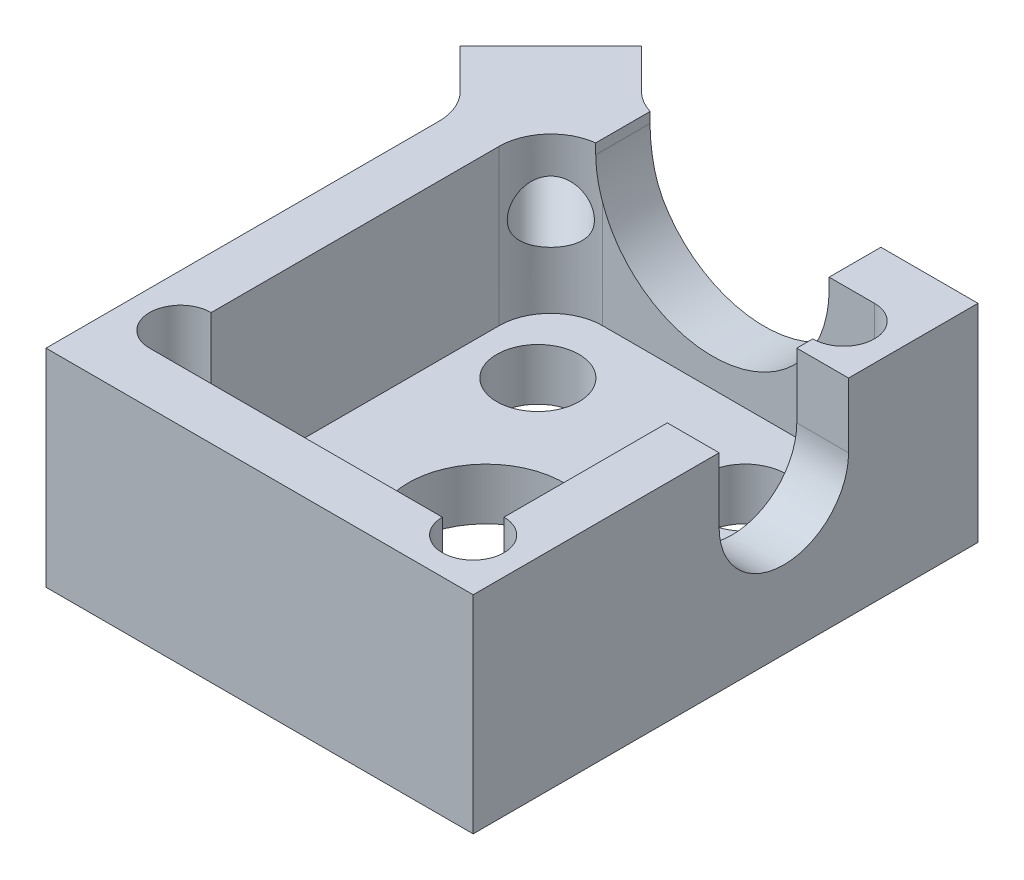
ISO-10303-21;
HEADER;
FILE_DESCRIPTION(('STEP AP214'),'2;1');
FILE_NAME('part.step','',(''),(''),'','','');
FILE_SCHEMA(('AUTOMOTIVE_DESIGN { 1 0 10303 214 1 1 1 1 }'));
ENDSEC;
DATA;
#1=APPLICATION_CONTEXT('core data for automotive mechanical design processes');
#2=APPLICATION_PROTOCOL_DEFINITION('international standard','automotive_design',2000,#1);
#3=PRODUCT_CONTEXT('',#1,'mechanical');
#4=PRODUCT('Part','Part','',(#3));
#5=PRODUCT_RELATED_PRODUCT_CATEGORY('part','',(#4));
#6=PRODUCT_DEFINITION_FORMATION('','',#4);
#7=PRODUCT_DEFINITION_CONTEXT('part definition',#1,'design');
#8=PRODUCT_DEFINITION('design','',#6,#7);
#9=PRODUCT_DEFINITION_SHAPE('','',#8);
#10=(LENGTH_UNIT() NAMED_UNIT(*) SI_UNIT(.MILLI.,.METRE.));
#11=(NAMED_UNIT(*) PLANE_ANGLE_UNIT() SI_UNIT($,.RADIAN.));
#12=(NAMED_UNIT(*) SI_UNIT($,.STERADIAN.) SOLID_ANGLE_UNIT());
#13=UNCERTAINTY_MEASURE_WITH_UNIT(LENGTH_MEASURE(1.E-05),#10,'distance_accuracy_value','');
#14=(GEOMETRIC_REPRESENTATION_CONTEXT(3) GLOBAL_UNCERTAINTY_ASSIGNED_CONTEXT((#13)) GLOBAL_UNIT_ASSIGNED_CONTEXT((#10,
#11,#12)) REPRESENTATION_CONTEXT('',''));
#15=CARTESIAN_POINT('',(0.,0.,0.));
#16=DIRECTION('',(0.,0.,1.));
#17=DIRECTION('',(1.,0.,0.));
#18=AXIS2_PLACEMENT_3D('',#15,#16,#17);
#19=CARTESIAN_POINT('',(4.125,4.,-4.875));
#20=DIRECTION('',(0.,0.,1.));
#21=DIRECTION('',(1.,0.,0.));
#22=AXIS2_PLACEMENT_3D('',#19,#20,#21);
#23=PLANE('',#22);
#24=CARTESIAN_POINT('',(0.,3.8,-4.875));
#25=DIRECTION('',(0.,0.,1.));
#26=DIRECTION('',(1.,0.,0.));
#27=AXIS2_PLACEMENT_3D('',#24,#25,#26);
#28=CIRCLE('',#27,2.25);
#29=CARTESIAN_POINT('',(2.25,3.8,-4.875));
#30=VERTEX_POINT('',#29);
#31=CARTESIAN_POINT('',(-1.96078643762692,2.69645274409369,-4.875));
#32=VERTEX_POINT('',#31);
#33=EDGE_CURVE('E87',#30,#32,#28,.F.);
#34=ORIENTED_EDGE('',*,*,#33,.F.);
#35=DIRECTION('',(0.,-1.,0.));
#36=VECTOR('',#35,1.);
#37=CARTESIAN_POINT('',(2.25,4.,-4.875));
#38=LINE('',#37,#36);
#39=CARTESIAN_POINT('',(2.25,4.,-4.875));
#40=VERTEX_POINT('',#39);
#41=EDGE_CURVE('E586',#40,#30,#38,.T.);
#42=ORIENTED_EDGE('',*,*,#41,.F.);
#43=DIRECTION('',(-1.,0.,0.));
#44=VECTOR('',#43,1.);
#45=CARTESIAN_POINT('',(4.125,4.,-4.875));
#46=LINE('',#45,#44);
#47=CARTESIAN_POINT('',(4.125,4.,-4.875));
#48=VERTEX_POINT('',#47);
#49=EDGE_CURVE('E38',#48,#40,#46,.T.);
#50=ORIENTED_EDGE('',*,*,#49,.F.);
#51=DIRECTION('',(0.,-1.,0.));
#52=VECTOR('',#51,1.);
#53=CARTESIAN_POINT('',(4.125,4.,-4.875));
#54=LINE('',#53,#52);
#55=CARTESIAN_POINT('',(4.125,0.,-4.875));
#56=VERTEX_POINT('',#55);
#57=EDGE_CURVE('E363',#48,#56,#54,.T.);
#58=ORIENTED_EDGE('',*,*,#57,.T.);
#59=DIRECTION('',(-1.,0.,0.));
#60=VECTOR('',#59,1.);
#61=CARTESIAN_POINT('',(4.125,0.,-4.875));
#62=LINE('',#61,#60);
#63=CARTESIAN_POINT('',(-1.96078643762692,0.,-4.875));
#64=VERTEX_POINT('',#63);
#65=EDGE_CURVE('E349',#56,#64,#62,.T.);
#66=ORIENTED_EDGE('',*,*,#65,.T.);
#67=DIRECTION('',(0.,1.,0.));
#68=VECTOR('',#67,1.);
#69=CARTESIAN_POINT('',(-1.96078643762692,4.,-4.875));
#70=LINE('',#69,#68);
#71=EDGE_CURVE('E385',#64,#32,#70,.T.);
#72=ORIENTED_EDGE('',*,*,#71,.T.);
#73=EDGE_LOOP('',(#34,#42,#50,#58,#66,#72));
#74=FACE_BOUND('',#73,.T.);
#75=ADVANCED_FACE('F34',(#74),#23,.F.);
#76=CARTESIAN_POINT('',(0.,4.,0.));
#77=DIRECTION('',(0.,-1.,0.));
#78=DIRECTION('',(0.,0.,-1.));
#79=AXIS2_PLACEMENT_3D('',#76,#77,#78);
#80=PLANE('',#79);
#81=DIRECTION('',(0.,0.,1.));
#82=VECTOR('',#81,1.);
#83=CARTESIAN_POINT('',(-2.25,4.,0.));
#84=LINE('',#83,#82);
#85=CARTESIAN_POINT('',(-2.25,4.,-4.91773539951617));
#86=VERTEX_POINT('',#85);
#87=CARTESIAN_POINT('',(-2.25,4.,-3.86715674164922));
#88=VERTEX_POINT('',#87);
#89=EDGE_CURVE('E548',#86,#88,#84,.T.);
#90=ORIENTED_EDGE('',*,*,#89,.F.);
#91=CARTESIAN_POINT('',(-1.96078643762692,4.,-5.875));
#92=DIRECTION('',(0.,-1.,0.));
#93=DIRECTION('',(0.,0.,-1.));
#94=AXIS2_PLACEMENT_3D('',#91,#92,#93);
#95=CIRCLE('',#94,1.);
#96=CARTESIAN_POINT('',(-2.66789321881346,4.,-5.16789321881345));
#97=VERTEX_POINT('',#96);
#98=EDGE_CURVE('E393',#86,#97,#95,.T.);
#99=ORIENTED_EDGE('',*,*,#98,.T.);
#100=DIRECTION('',(-0.707106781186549,0.,-0.707106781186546));
#101=VECTOR('',#100,1.);
#102=CARTESIAN_POINT('',(-2.37500000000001,4.,-4.875));
#103=LINE('',#102,#101);
#104=CARTESIAN_POINT('',(-3.42677669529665,4.,-5.92677669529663));
#105=VERTEX_POINT('',#104);
#106=EDGE_CURVE('E228',#97,#105,#103,.T.);
#107=ORIENTED_EDGE('',*,*,#106,.T.);
#108=DIRECTION('',(-0.707106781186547,0.,0.707106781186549));
#109=VECTOR('',#108,1.);
#110=CARTESIAN_POINT('',(-3.42677669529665,4.,-5.92677669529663));
#111=LINE('',#110,#109);
#112=CARTESIAN_POINT('',(-5.17677669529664,4.,-4.17677669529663));
#113=VERTEX_POINT('',#112);
#114=EDGE_CURVE('E222',#105,#113,#111,.T.);
#115=ORIENTED_EDGE('',*,*,#114,.T.);
#116=DIRECTION('',(0.707106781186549,0.,0.707106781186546));
#117=VECTOR('',#116,1.);
#118=CARTESIAN_POINT('',(-5.17677669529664,4.,-4.17677669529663));
#119=LINE('',#118,#117);
#120=CARTESIAN_POINT('',(-4.41789321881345,4.,-3.41789321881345));
#121=VERTEX_POINT('',#120);
#122=EDGE_CURVE('E214',#113,#121,#119,.T.);
#123=ORIENTED_EDGE('',*,*,#122,.T.);
#124=CARTESIAN_POINT('',(-5.125,4.,-2.7107864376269));
#125=DIRECTION('',(0.,-1.,0.));
#126=DIRECTION('',(0.,0.,-1.));
#127=AXIS2_PLACEMENT_3D('',#124,#125,#126);
#128=CIRCLE('',#127,1.);
#129=CARTESIAN_POINT('',(-4.125,4.,-2.7107864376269));
#130=VERTEX_POINT('',#129);
#131=EDGE_CURVE('E200',#121,#130,#128,.T.);
#132=ORIENTED_EDGE('',*,*,#131,.T.);
#133=DIRECTION('',(0.,0.,1.));
#134=VECTOR('',#133,1.);
#135=CARTESIAN_POINT('',(-4.125,4.,-4.875));
#136=LINE('',#135,#134);
#137=CARTESIAN_POINT('',(-4.125,4.,4.875));
#138=VERTEX_POINT('',#137);
#139=EDGE_CURVE('E346',#130,#138,#136,.T.);
#140=ORIENTED_EDGE('',*,*,#139,.T.);
#141=DIRECTION('',(1.,0.,0.));
#142=VECTOR('',#141,1.);
#143=CARTESIAN_POINT('',(4.125,4.,4.875));
#144=LINE('',#143,#142);
#145=CARTESIAN_POINT('',(4.125,4.,4.875));
#146=VERTEX_POINT('',#145);
#147=EDGE_CURVE('E348',#138,#146,#144,.T.);
#148=ORIENTED_EDGE('',*,*,#147,.T.);
#149=DIRECTION('',(0.,0.,-1.));
#150=VECTOR('',#149,1.);
#151=CARTESIAN_POINT('',(4.125,4.,-4.875));
#152=LINE('',#151,#150);
#153=CARTESIAN_POINT('',(4.125,4.,0.125));
#154=VERTEX_POINT('',#153);
#155=EDGE_CURVE('E352',#146,#154,#152,.T.);
#156=ORIENTED_EDGE('',*,*,#155,.T.);
#157=DIRECTION('',(1.,0.,0.));
#158=VECTOR('',#157,1.);
#159=CARTESIAN_POINT('',(-0.410533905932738,4.,0.125000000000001));
#160=LINE('',#159,#158);
#161=CARTESIAN_POINT('',(3.125,4.,0.125000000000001));
#162=VERTEX_POINT('',#161);
#163=EDGE_CURVE('E259',#162,#154,#160,.T.);
#164=ORIENTED_EDGE('',*,*,#163,.F.);
#165=DIRECTION('',(0.,0.,-1.));
#166=VECTOR('',#165,1.);
#167=CARTESIAN_POINT('',(3.125,4.,-3.875));
#168=LINE('',#167,#166);
#169=CARTESIAN_POINT('',(3.125,4.,3.2796875));
#170=VERTEX_POINT('',#169);
#171=EDGE_CURVE('E322',#170,#162,#168,.T.);
#172=ORIENTED_EDGE('',*,*,#171,.F.);
#173=CARTESIAN_POINT('',(3.125,4.,3.875));
#174=DIRECTION('',(0.,1.,0.));
#175=DIRECTION('',(0.,0.,1.));
#176=AXIS2_PLACEMENT_3D('',#173,#174,#175);
#177=CIRCLE('',#176,0.595312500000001);
#178=CARTESIAN_POINT('',(2.5296875,4.,3.875));
#179=VERTEX_POINT('',#178);
#180=EDGE_CURVE('E288',#179,#170,#177,.T.);
#181=ORIENTED_EDGE('',*,*,#180,.F.);
#182=DIRECTION('',(1.,0.,0.));
#183=VECTOR('',#182,1.);
#184=CARTESIAN_POINT('',(3.125,4.,3.875));
#185=LINE('',#184,#183);
#186=CARTESIAN_POINT('',(-3.125,4.,3.875));
#187=VERTEX_POINT('',#186);
#188=EDGE_CURVE('E326',#187,#179,#185,.T.);
#189=ORIENTED_EDGE('',*,*,#188,.F.);
#190=CARTESIAN_POINT('',(-3.125,4.,3.2796875));
#191=DIRECTION('',(0.,1.,0.));
#192=DIRECTION('',(0.,0.,1.));
#193=AXIS2_PLACEMENT_3D('',#190,#191,#192);
#194=CIRCLE('',#193,0.5953125);
#195=CARTESIAN_POINT('',(-3.125,4.,2.684375));
#196=VERTEX_POINT('',#195);
#197=EDGE_CURVE('E306',#196,#187,#194,.T.);
#198=ORIENTED_EDGE('',*,*,#197,.F.);
#199=DIRECTION('',(0.,0.,1.));
#200=VECTOR('',#199,1.);
#201=CARTESIAN_POINT('',(-3.125,4.,-3.875));
#202=LINE('',#201,#200);
#203=CARTESIAN_POINT('',(-3.125,4.,-2.875));
#204=VERTEX_POINT('',#203);
#205=EDGE_CURVE('E315',#204,#196,#202,.T.);
#206=ORIENTED_EDGE('',*,*,#205,.F.);
#207=CARTESIAN_POINT('',(-2.125,4.,-2.875));
#208=DIRECTION('',(0.,-1.,0.));
#209=DIRECTION('',(0.,0.,-1.));
#210=AXIS2_PLACEMENT_3D('',#207,#208,#209);
#211=CIRCLE('',#210,1.);
#212=EDGE_CURVE('E390',#204,#88,#211,.T.);
#213=ORIENTED_EDGE('',*,*,#212,.T.);
#214=EDGE_LOOP('',(#90,#99,#107,#115,#123,#132,#140,#148,#156,#164,#172,#181,#189,#198,#206,#213));
#215=FACE_BOUND('',#214,.T.);
#216=ADVANCED_FACE('F220',(#215),#80,.F.);
#217=DIRECTION('',(0.,0.,-1.));
#218=VECTOR('',#217,1.);
#219=CARTESIAN_POINT('',(2.25,4.,4.876));
#220=LINE('',#219,#218);
#221=CARTESIAN_POINT('',(2.25,4.,-3.875));
#222=VERTEX_POINT('',#221);
#223=EDGE_CURVE('E590',#222,#40,#220,.T.);
#224=ORIENTED_EDGE('',*,*,#223,.F.);
#225=DIRECTION('',(-1.,0.,0.));
#226=VECTOR('',#225,1.);
#227=CARTESIAN_POINT('',(3.125,4.,-3.875));
#228=LINE('',#227,#226);
#229=CARTESIAN_POINT('',(3.125,4.,-3.875));
#230=VERTEX_POINT('',#229);
#231=EDGE_CURVE('E318',#230,#222,#228,.T.);
#232=ORIENTED_EDGE('',*,*,#231,.F.);
#233=CARTESIAN_POINT('',(3.125,4.,-3.2796875));
#234=DIRECTION('',(0.,1.,0.));
#235=DIRECTION('',(0.,0.,1.));
#236=AXIS2_PLACEMENT_3D('',#233,#234,#235);
#237=CIRCLE('',#236,0.595312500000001);
#238=CARTESIAN_POINT('',(3.125,4.,-2.684375));
#239=VERTEX_POINT('',#238);
#240=EDGE_CURVE('E298',#239,#230,#237,.T.);
#241=ORIENTED_EDGE('',*,*,#240,.F.);
#242=CARTESIAN_POINT('',(3.125,4.,-2.375));
#243=VERTEX_POINT('',#242);
#244=EDGE_CURVE('E325',#243,#239,#168,.T.);
#245=ORIENTED_EDGE('',*,*,#244,.F.);
#246=DIRECTION('',(1.,0.,0.));
#247=VECTOR('',#246,1.);
#248=CARTESIAN_POINT('',(-0.410533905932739,4.,-2.375));
#249=LINE('',#248,#247);
#250=CARTESIAN_POINT('',(4.125,4.,-2.375));
#251=VERTEX_POINT('',#250);
#252=EDGE_CURVE('E261',#243,#251,#249,.T.);
#253=ORIENTED_EDGE('',*,*,#252,.T.);
#254=EDGE_CURVE('E351',#251,#48,#152,.T.);
#255=ORIENTED_EDGE('',*,*,#254,.T.);
#256=ORIENTED_EDGE('',*,*,#49,.T.);
#257=EDGE_LOOP('',(#224,#232,#241,#245,#253,#255,#256));
#258=FACE_BOUND('',#257,.T.);
#259=ADVANCED_FACE('F480',(#258),#80,.F.);
#260=CARTESIAN_POINT('',(3.125,-9.95615387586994,-3.875));
#261=DIRECTION('',(0.,0.,-1.));
#262=DIRECTION('',(-1.,0.,0.));
#263=AXIS2_PLACEMENT_3D('',#260,#261,#262);
#264=PLANE('',#263);
#265=CARTESIAN_POINT('',(0.,3.8,-3.875));
#266=DIRECTION('',(0.,0.,-1.));
#267=DIRECTION('',(-1.,0.,0.));
#268=AXIS2_PLACEMENT_3D('',#265,#266,#267);
#269=CIRCLE('',#268,2.25);
#270=CARTESIAN_POINT('',(-2.125,3.06049002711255,-3.875));
#271=VERTEX_POINT('',#270);
#272=CARTESIAN_POINT('',(2.25,3.8,-3.875));
#273=VERTEX_POINT('',#272);
#274=EDGE_CURVE('E602',#271,#273,#269,.F.);
#275=ORIENTED_EDGE('',*,*,#274,.F.);
#276=DIRECTION('',(0.,1.,0.));
#277=VECTOR('',#276,1.);
#278=CARTESIAN_POINT('',(-2.125,3.29563,-3.875));
#279=LINE('',#278,#277);
#280=CARTESIAN_POINT('',(-2.125,1.,-3.875));
#281=VERTEX_POINT('',#280);
#282=EDGE_CURVE('E381',#271,#281,#279,.F.);
#283=ORIENTED_EDGE('',*,*,#282,.T.);
#284=DIRECTION('',(-1.,0.,0.));
#285=VECTOR('',#284,1.);
#286=CARTESIAN_POINT('',(3.125,1.,-3.875));
#287=LINE('',#286,#285);
#288=CARTESIAN_POINT('',(3.125,1.,-3.875));
#289=VERTEX_POINT('',#288);
#290=EDGE_CURVE('E336',#289,#281,#287,.T.);
#291=ORIENTED_EDGE('',*,*,#290,.F.);
#292=DIRECTION('',(0.,1.,0.));
#293=VECTOR('',#292,1.);
#294=CARTESIAN_POINT('',(3.125,-9.95615387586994,-3.875));
#295=LINE('',#294,#293);
#296=EDGE_CURVE('E339',#289,#230,#295,.T.);
#297=ORIENTED_EDGE('',*,*,#296,.T.);
#298=ORIENTED_EDGE('',*,*,#231,.T.);
#299=DIRECTION('',(0.,1.,0.));
#300=VECTOR('',#299,1.);
#301=CARTESIAN_POINT('',(2.25,3.8,-3.875));
#302=LINE('',#301,#300);
#303=EDGE_CURVE('E835',#273,#222,#302,.T.);
#304=ORIENTED_EDGE('',*,*,#303,.F.);
#305=EDGE_LOOP('',(#275,#283,#291,#297,#298,#304));
#306=FACE_BOUND('',#305,.T.);
#307=ADVANCED_FACE('F477',(#306),#264,.F.);
#308=CARTESIAN_POINT('',(-2.125,-9.95615387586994,-2.875));
#309=DIRECTION('',(0.,-1.,0.));
#310=DIRECTION('',(0.,0.,-1.));
#311=AXIS2_PLACEMENT_3D('',#308,#309,#310);
#312=CYLINDRICAL_SURFACE('',#311,1.);
#313=CARTESIAN_POINT('',(-3.11416384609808,2.7,-3.0218158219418));
#314=CARTESIAN_POINT('',(-3.1141635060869,2.73002423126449,-3.02181381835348));
#315=CARTESIAN_POINT('',(-3.11375691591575,2.76004261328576,-3.02463892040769));
#316=CARTESIAN_POINT('',(-3.11203328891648,2.81907449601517,-3.03560785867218));
#317=CARTESIAN_POINT('',(-3.11071531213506,2.84808692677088,-3.04375718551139));
#318=CARTESIAN_POINT('',(-3.10693338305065,2.90412510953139,-3.06451455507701));
#319=CARTESIAN_POINT('',(-3.10447753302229,2.93116336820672,-3.077090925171));
#320=CARTESIAN_POINT('',(-3.09810438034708,2.98305594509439,-3.10583386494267));
#321=CARTESIAN_POINT('',(-3.09418662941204,3.00790959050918,-3.12200153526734));
#322=CARTESIAN_POINT('',(-3.08396658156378,3.05800867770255,-3.15925156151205));
#323=CARTESIAN_POINT('',(-3.07743413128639,3.08294160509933,-3.18069116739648));
#324=CARTESIAN_POINT('',(-3.0616340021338,3.12939525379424,-3.22613574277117));
#325=CARTESIAN_POINT('',(-3.05236431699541,3.15091345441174,-3.25014258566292));
#326=CARTESIAN_POINT('',(-3.02951994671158,3.19217989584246,-3.30248313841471));
#327=CARTESIAN_POINT('',(-3.0155933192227,3.21149937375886,-3.33100583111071));
#328=CARTESIAN_POINT('',(-2.98351319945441,3.24466681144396,-3.38885312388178));
#329=CARTESIAN_POINT('',(-2.9653635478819,3.25851971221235,-3.41817697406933));
#330=CARTESIAN_POINT('',(-2.92677571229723,3.27896566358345,-3.47348398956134));
#331=CARTESIAN_POINT('',(-2.90671513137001,3.286120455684,-3.49952126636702));
#332=CARTESIAN_POINT('',(-2.86358297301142,3.29486385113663,-3.5499762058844));
#333=CARTESIAN_POINT('',(-2.84051419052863,3.29645758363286,-3.57439534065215));
#334=CARTESIAN_POINT('',(-2.79515912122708,3.29413858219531,-3.6177992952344));
#335=CARTESIAN_POINT('',(-2.77312194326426,3.2908752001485,-3.6370835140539));
#336=CARTESIAN_POINT('',(-2.72808314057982,3.28016516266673,-3.67320038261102));
#337=CARTESIAN_POINT('',(-2.70508144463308,3.27271819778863,-3.69003285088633));
#338=CARTESIAN_POINT('',(-2.6587217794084,3.25391500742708,-3.7211241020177));
#339=CARTESIAN_POINT('',(-2.635362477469,3.2425343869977,-3.73536595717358));
#340=CARTESIAN_POINT('',(-2.5891383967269,3.2162810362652,-3.7611586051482));
#341=CARTESIAN_POINT('',(-2.56627375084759,3.20140737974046,-3.77270868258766));
#342=CARTESIAN_POINT('',(-2.51903326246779,3.1666008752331,-3.79450638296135));
#343=CARTESIAN_POINT('',(-2.4947994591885,3.14627735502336,-3.80443742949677));
#344=CARTESIAN_POINT('',(-2.4485741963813,3.10215822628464,-3.82152445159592));
#345=CARTESIAN_POINT('',(-2.42658579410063,3.07835798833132,-3.82867667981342));
#346=CARTESIAN_POINT('',(-2.38345175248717,3.02476162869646,-3.84131383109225));
#347=CARTESIAN_POINT('',(-2.3626841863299,2.99459166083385,-3.84651785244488));
#348=CARTESIAN_POINT('',(-2.3265611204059,2.93090104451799,-3.8546519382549));
#349=CARTESIAN_POINT('',(-2.31119569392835,2.89738668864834,-3.85758618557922));
#350=CARTESIAN_POINT('',(-2.29038981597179,2.83637317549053,-3.86127035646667));
#351=CARTESIAN_POINT('',(-2.28344042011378,2.80941041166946,-3.86237919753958));
#352=CARTESIAN_POINT('',(-2.27413326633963,2.75469321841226,-3.86382889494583));
#353=CARTESIAN_POINT('',(-2.27177032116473,2.72693971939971,-3.86417061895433));
#354=CARTESIAN_POINT('',(-2.27186273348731,2.67140763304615,-3.86415686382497));
#355=CARTESIAN_POINT('',(-2.2743241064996,2.64362905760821,-3.86380051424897));
#356=CARTESIAN_POINT('',(-2.28383143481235,2.58888383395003,-3.8623169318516));
#357=CARTESIAN_POINT('',(-2.29088097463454,2.56191783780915,-3.86118909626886));
#358=CARTESIAN_POINT('',(-2.30897542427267,2.50941142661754,-3.85797328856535));
#359=CARTESIAN_POINT('',(-2.32002473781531,2.48387261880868,-3.8558842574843));
#360=CARTESIAN_POINT('',(-2.34540551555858,2.43463044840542,-3.85049446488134));
#361=CARTESIAN_POINT('',(-2.35973823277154,2.41092779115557,-3.84719324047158));
#362=CARTESIAN_POINT('',(-2.39381334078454,2.3615534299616,-3.83838002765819));
#363=CARTESIAN_POINT('',(-2.41406461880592,2.33628400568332,-3.83257883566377));
#364=CARTESIAN_POINT('',(-2.4572714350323,2.28893654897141,-3.81845812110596));
#365=CARTESIAN_POINT('',(-2.48022950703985,2.26686155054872,-3.81013622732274));
#366=CARTESIAN_POINT('',(-2.5310053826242,2.22374858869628,-3.78933170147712));
#367=CARTESIAN_POINT('',(-2.55907183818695,2.20318587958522,-3.77645878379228));
#368=CARTESIAN_POINT('',(-2.61634066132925,2.16731019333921,-3.74656454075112));
#369=CARTESIAN_POINT('',(-2.64554223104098,2.15199360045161,-3.72954608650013));
#370=CARTESIAN_POINT('',(-2.70156448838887,2.12830886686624,-3.6926870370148));
#371=CARTESIAN_POINT('',(-2.72840064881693,2.11950848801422,-3.67315067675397));
#372=CARTESIAN_POINT('',(-2.78068721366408,2.10761704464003,-3.63077910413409));
#373=CARTESIAN_POINT('',(-2.80613910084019,2.10451974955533,-3.60794752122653));
#374=CARTESIAN_POINT('',(-2.85138653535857,2.10424954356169,-3.56292918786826));
#375=CARTESIAN_POINT('',(-2.87148653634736,2.10635497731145,-3.54104843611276));
#376=CARTESIAN_POINT('',(-2.90928297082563,2.11490664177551,-3.49609752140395));
#377=CARTESIAN_POINT('',(-2.92697935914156,2.12135295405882,-3.47302733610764));
#378=CARTESIAN_POINT('',(-2.95946035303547,2.13816612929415,-3.42678359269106));
#379=CARTESIAN_POINT('',(-2.97427995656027,2.14848070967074,-3.40361531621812));
#380=CARTESIAN_POINT('',(-3.00125450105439,2.17264699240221,-3.35758735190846));
#381=CARTESIAN_POINT('',(-3.01340882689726,2.18649950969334,-3.33472773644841));
#382=CARTESIAN_POINT('',(-3.03636935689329,2.2190418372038,-3.28751409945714));
#383=CARTESIAN_POINT('',(-3.04688410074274,2.23809438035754,-3.26326887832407));
#384=CARTESIAN_POINT('',(-3.06512913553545,2.27964794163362,-3.21673571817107));
#385=CARTESIAN_POINT('',(-3.07285624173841,2.30215286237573,-3.19445003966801));
#386=CARTESIAN_POINT('',(-3.08673133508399,2.35323648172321,-3.15009382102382));
#387=CARTESIAN_POINT('',(-3.09256612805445,2.38222208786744,-3.12839027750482));
#388=CARTESIAN_POINT('',(-3.10183967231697,2.44364675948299,-3.08988964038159));
#389=CARTESIAN_POINT('',(-3.10528015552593,2.4760833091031,-3.07308900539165));
#390=CARTESIAN_POINT('',(-3.11009623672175,2.54004291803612,-3.04744774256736));
#391=CARTESIAN_POINT('',(-3.11165596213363,2.57128049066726,-3.03793930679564));
#392=CARTESIAN_POINT('',(-3.11368890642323,2.63501602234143,-3.02513039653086));
#393=CARTESIAN_POINT('',(-3.11416421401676,2.66751143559,-3.02181798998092));
#394=CARTESIAN_POINT('',(-3.11416384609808,2.7,-3.0218158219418));
#395=B_SPLINE_CURVE_WITH_KNOTS('',3,(#313,#314,#315,#316,#317,#318,#319,#320,#321,#322,#323,
#324,#325,#326,#327,#328,#329,#330,#331,#332,#333,#334,#335,#336,#337,#338,#339,#340,#341,#342,
#343,#344,#345,#346,#347,#348,#349,#350,#351,#352,#353,#354,#355,#356,#357,#358,#359,#360,#361,
#362,#363,#364,#365,#366,#367,#368,#369,#370,#371,#372,#373,#374,#375,#376,#377,#378,#379,#380,
#381,#382,#383,#384,#385,#386,#387,#388,#389,#390,#391,#392,#393,#394),.UNSPECIFIED.,.T.,.F.,(4,
2,2,2,2,2,2,2,2,2,2,2,2,2,2,2,2,2,2,2,2,2,2,2,2,2,2,2,2,2,2,2,2,2,2,2,2,2,2,2,4),(0.,
0.0899365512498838,0.179965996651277,0.269364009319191,0.358789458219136,0.458972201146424,
0.559228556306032,0.67010208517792,0.780875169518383,0.881194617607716,0.981421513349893,
1.06939557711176,1.15737614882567,1.24591243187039,1.33447221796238,1.43352735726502,
1.53271561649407,1.64314744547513,1.75337527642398,1.83661405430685,1.91975863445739,
2.00300695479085,2.08632039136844,2.16972583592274,2.25316316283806,2.35147520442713,
2.44988001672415,2.56059598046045,2.67123548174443,2.77364207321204,2.87593671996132,
2.96485649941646,3.05377794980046,3.14153850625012,3.22931929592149,3.326670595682,
3.42413276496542,3.53364037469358,3.64306868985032,3.74057503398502,3.83789341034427),.UNSPECIFIED.);
#396=CARTESIAN_POINT('',(-2.83210678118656,2.10437,-3.58210678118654));
#397=VERTEX_POINT('',#396);
#398=CARTESIAN_POINT('',(-2.83210678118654,3.29563,-3.58210678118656));
#399=VERTEX_POINT('',#398);
#400=EDGE_CURVE('E234',#397,#399,#395,.T.);
#401=ORIENTED_EDGE('',*,*,#400,.T.);
#402=CARTESIAN_POINT('',(-2.2718158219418,2.7,-3.86416384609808));
#403=CARTESIAN_POINT('',(-2.27181381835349,2.66997576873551,-3.8641635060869));
#404=CARTESIAN_POINT('',(-2.2746389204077,2.63995738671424,-3.86375691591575));
#405=CARTESIAN_POINT('',(-2.28560785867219,2.58092550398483,-3.86203328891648));
#406=CARTESIAN_POINT('',(-2.2937571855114,2.55191307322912,-3.86071531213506));
#407=CARTESIAN_POINT('',(-2.31451455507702,2.49587489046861,-3.85693338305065));
#408=CARTESIAN_POINT('',(-2.327090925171,2.46883663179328,-3.85447753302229));
#409=CARTESIAN_POINT('',(-2.35583386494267,2.41694405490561,-3.84810438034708));
#410=CARTESIAN_POINT('',(-2.37200153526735,2.39209040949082,-3.84418662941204));
#411=CARTESIAN_POINT('',(-2.40925156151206,2.34199132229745,-3.83396658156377));
#412=CARTESIAN_POINT('',(-2.43069116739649,2.31705839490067,-3.82743413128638));
#413=CARTESIAN_POINT('',(-2.47613574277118,2.27060474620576,-3.8116340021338));
#414=CARTESIAN_POINT('',(-2.50014258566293,2.24908654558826,-3.8023643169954));
#415=CARTESIAN_POINT('',(-2.55248313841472,2.20782010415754,-3.77951994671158));
#416=CARTESIAN_POINT('',(-2.58100583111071,2.18850062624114,-3.7655933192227));
#417=CARTESIAN_POINT('',(-2.63885312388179,2.15533318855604,-3.73351319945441));
#418=CARTESIAN_POINT('',(-2.66817697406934,2.14148028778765,-3.7153635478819));
#419=CARTESIAN_POINT('',(-2.72348398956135,2.12103433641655,-3.67677571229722));
#420=CARTESIAN_POINT('',(-2.74952126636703,2.113879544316,-3.65671513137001));
#421=CARTESIAN_POINT('',(-2.7999762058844,2.10513614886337,-3.61358297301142));
#422=CARTESIAN_POINT('',(-2.82439534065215,2.10354241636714,-3.59051419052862));
#423=CARTESIAN_POINT('',(-2.86779929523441,2.10586141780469,-3.54515912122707));
#424=CARTESIAN_POINT('',(-2.8870835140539,2.1091247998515,-3.52312194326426));
#425=CARTESIAN_POINT('',(-2.92320038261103,2.11983483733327,-3.47808314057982));
#426=CARTESIAN_POINT('',(-2.94003285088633,2.12728180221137,-3.45508144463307));
#427=CARTESIAN_POINT('',(-2.9711241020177,2.14608499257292,-3.40872177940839));
#428=CARTESIAN_POINT('',(-2.98536595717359,2.1574656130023,-3.38536247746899));
#429=CARTESIAN_POINT('',(-3.01115860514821,2.1837189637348,-3.33913839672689));
#430=CARTESIAN_POINT('',(-3.02270868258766,2.19859262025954,-3.31627375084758));
#431=CARTESIAN_POINT('',(-3.04450638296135,2.2333991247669,-3.26903326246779));
#432=CARTESIAN_POINT('',(-3.05443742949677,2.25372264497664,-3.24479945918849));
#433=CARTESIAN_POINT('',(-3.07152445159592,2.29784177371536,-3.1985741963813));
#434=CARTESIAN_POINT('',(-3.07867667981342,2.32164201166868,-3.17658579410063));
#435=CARTESIAN_POINT('',(-3.09131383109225,2.37523837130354,-3.13345175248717));
#436=CARTESIAN_POINT('',(-3.09651785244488,2.40540833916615,-3.11268418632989));
#437=CARTESIAN_POINT('',(-3.1046519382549,2.46909895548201,-3.07656112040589));
#438=CARTESIAN_POINT('',(-3.10758618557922,2.50261331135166,-3.06119569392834));
#439=CARTESIAN_POINT('',(-3.11127035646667,2.56362682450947,-3.04038981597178));
#440=CARTESIAN_POINT('',(-3.11237919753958,2.59058958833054,-3.03344042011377));
#441=CARTESIAN_POINT('',(-3.11382889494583,2.64530678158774,-3.02413326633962));
#442=CARTESIAN_POINT('',(-3.11417061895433,2.67306028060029,-3.02177032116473));
#443=CARTESIAN_POINT('',(-3.11415686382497,2.72859236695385,-3.0218627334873));
#444=CARTESIAN_POINT('',(-3.11380051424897,2.75637094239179,-3.02432410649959));
#445=CARTESIAN_POINT('',(-3.1123169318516,2.81111616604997,-3.03383143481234));
#446=CARTESIAN_POINT('',(-3.11118909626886,2.83808216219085,-3.04088097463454));
#447=CARTESIAN_POINT('',(-3.10797328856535,2.89058857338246,-3.05897542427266));
#448=CARTESIAN_POINT('',(-3.1058842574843,2.91612738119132,-3.07002473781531));
#449=CARTESIAN_POINT('',(-3.10049446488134,2.96536955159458,-3.09540551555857));
#450=CARTESIAN_POINT('',(-3.09719324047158,2.98907220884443,-3.10973823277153));
#451=CARTESIAN_POINT('',(-3.08838002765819,3.0384465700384,-3.14381334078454));
#452=CARTESIAN_POINT('',(-3.08257883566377,3.06371599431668,-3.16406461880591));
#453=CARTESIAN_POINT('',(-3.06845812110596,3.11106345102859,-3.2072714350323));
#454=CARTESIAN_POINT('',(-3.06013622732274,3.13313844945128,-3.23022950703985));
#455=CARTESIAN_POINT('',(-3.03933170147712,3.17625141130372,-3.28100538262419));
#456=CARTESIAN_POINT('',(-3.02645878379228,3.19681412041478,-3.30907183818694));
#457=CARTESIAN_POINT('',(-2.99656454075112,3.23268980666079,-3.36634066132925));
#458=CARTESIAN_POINT('',(-2.97954608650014,3.24800639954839,-3.39554223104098));
#459=CARTESIAN_POINT('',(-2.9426870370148,3.27169113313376,-3.45156448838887));
#460=CARTESIAN_POINT('',(-2.92315067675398,3.28049151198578,-3.47840064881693));
#461=CARTESIAN_POINT('',(-2.88077910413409,3.29238295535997,-3.53068721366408));
#462=CARTESIAN_POINT('',(-2.85794752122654,3.29548025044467,-3.55613910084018));
#463=CARTESIAN_POINT('',(-2.81292918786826,3.29575045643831,-3.60138653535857));
#464=CARTESIAN_POINT('',(-2.79104843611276,3.29364502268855,-3.62148653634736));
#465=CARTESIAN_POINT('',(-2.74609752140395,3.28509335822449,-3.65928297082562));
#466=CARTESIAN_POINT('',(-2.72302733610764,3.27864704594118,-3.67697935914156));
#467=CARTESIAN_POINT('',(-2.67678359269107,3.26183387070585,-3.70946035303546));
#468=CARTESIAN_POINT('',(-2.65361531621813,3.25151929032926,-3.72427995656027));
#469=CARTESIAN_POINT('',(-2.60758735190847,3.22735300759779,-3.75125450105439));
#470=CARTESIAN_POINT('',(-2.58472773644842,3.21350049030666,-3.76340882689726));
#471=CARTESIAN_POINT('',(-2.53751409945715,3.1809581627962,-3.78636935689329));
#472=CARTESIAN_POINT('',(-2.51326887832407,3.16190561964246,-3.79688410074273));
#473=CARTESIAN_POINT('',(-2.46673571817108,3.12035205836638,-3.81512913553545));
#474=CARTESIAN_POINT('',(-2.44445003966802,3.09784713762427,-3.82285624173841));
#475=CARTESIAN_POINT('',(-2.40009382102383,3.04676351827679,-3.83673133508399));
#476=CARTESIAN_POINT('',(-2.37839027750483,3.01777791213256,-3.84256612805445));
#477=CARTESIAN_POINT('',(-2.3398896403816,2.95635324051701,-3.85183967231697));
#478=CARTESIAN_POINT('',(-2.32308900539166,2.9239166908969,-3.85528015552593));
#479=CARTESIAN_POINT('',(-2.29744774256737,2.85995708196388,-3.86009623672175));
#480=CARTESIAN_POINT('',(-2.28793930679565,2.82871950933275,-3.86165596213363));
#481=CARTESIAN_POINT('',(-2.27513039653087,2.76498397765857,-3.86368890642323));
#482=CARTESIAN_POINT('',(-2.27181798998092,2.73248856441,-3.86416421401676));
#483=CARTESIAN_POINT('',(-2.2718158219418,2.7,-3.86416384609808));
#484=B_SPLINE_CURVE_WITH_KNOTS('',3,(#402,#403,#404,#405,#406,#407,#408,#409,#410,#411,#412,
#413,#414,#415,#416,#417,#418,#419,#420,#421,#422,#423,#424,#425,#426,#427,#428,#429,#430,#431,
#432,#433,#434,#435,#436,#437,#438,#439,#440,#441,#442,#443,#444,#445,#446,#447,#448,#449,#450,
#451,#452,#453,#454,#455,#456,#457,#458,#459,#460,#461,#462,#463,#464,#465,#466,#467,#468,#469,
#470,#471,#472,#473,#474,#475,#476,#477,#478,#479,#480,#481,#482,#483),.UNSPECIFIED.,.T.,.F.,(4,
2,2,2,2,2,2,2,2,2,2,2,2,2,2,2,2,2,2,2,2,2,2,2,2,2,2,2,2,2,2,2,2,2,2,2,2,2,2,2,4),(0.,
0.0899365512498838,0.179965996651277,0.269364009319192,0.358789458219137,0.458972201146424,
0.559228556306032,0.67010208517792,0.780875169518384,0.881194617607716,0.981421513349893,
1.06939557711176,1.15737614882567,1.24591243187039,1.33447221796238,1.43352735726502,
1.53271561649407,1.64314744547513,1.75337527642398,1.83661405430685,1.9197586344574,
2.00300695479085,2.08632039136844,2.16972583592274,2.25316316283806,2.35147520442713,
2.44988001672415,2.56059598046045,2.67123548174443,2.77364207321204,2.87593671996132,
2.96485649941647,3.05377794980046,3.14153850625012,3.22931929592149,3.326670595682,
3.42413276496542,3.53364037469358,3.64306868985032,3.74057503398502,3.83789341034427),.UNSPECIFIED.);
#485=EDGE_CURVE('E76',#399,#397,#484,.T.);
#486=ORIENTED_EDGE('',*,*,#485,.T.);
#487=EDGE_LOOP('',(#401,#486));
#488=FACE_BOUND('',#487,.T.);
#489=CARTESIAN_POINT('',(-2.25,3.8,-3.86715674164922));
#490=CARTESIAN_POINT('',(-2.25000613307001,3.73698030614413,-3.86711401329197));
#491=CARTESIAN_POINT('',(-2.24735239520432,3.67396493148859,-3.86749053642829));
#492=CARTESIAN_POINT('',(-2.23680966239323,3.54882036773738,-3.86875412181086));
#493=CARTESIAN_POINT('',(-2.22895724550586,3.48668806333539,-3.86963761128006));
#494=CARTESIAN_POINT('',(-2.20810036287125,3.36329875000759,-3.87159553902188));
#495=CARTESIAN_POINT('',(-2.19509600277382,3.30204172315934,-3.87266997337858));
#496=CARTESIAN_POINT('',(-2.16392283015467,3.18039168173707,-3.87435648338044));
#497=CARTESIAN_POINT('',(-2.14571838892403,3.1200077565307,-3.87496525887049));
#498=CARTESIAN_POINT('',(-2.125,3.06049002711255,-3.875));
#499=B_SPLINE_CURVE_WITH_KNOTS('',3,(#489,#490,#491,#492,#493,#494,#495,#496,#497,#498),
.UNSPECIFIED.,.F.,.F.,(4,2,2,2,4),(0.,0.188995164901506,0.376674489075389,0.564349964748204,
0.753343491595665),.UNSPECIFIED.);
#500=CARTESIAN_POINT('',(-2.25,3.8,-3.86715674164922));
#501=VERTEX_POINT('',#500);
#502=EDGE_CURVE('E603',#501,#271,#499,.T.);
#503=ORIENTED_EDGE('',*,*,#502,.F.);
#504=DIRECTION('',(0.,-1.,0.));
#505=VECTOR('',#504,1.);
#506=CARTESIAN_POINT('',(-2.25,-9.95615387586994,-3.86715674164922));
#507=LINE('',#506,#505);
#508=EDGE_CURVE('E546',#88,#501,#507,.T.);
#509=ORIENTED_EDGE('',*,*,#508,.F.);
#510=ORIENTED_EDGE('',*,*,#212,.F.);
#511=DIRECTION('',(0.,1.,0.));
#512=VECTOR('',#511,1.);
#513=CARTESIAN_POINT('',(-3.125,4.,-2.875));
#514=LINE('',#513,#512);
#515=CARTESIAN_POINT('',(-3.125,1.,-2.875));
#516=VERTEX_POINT('',#515);
#517=EDGE_CURVE('E378',#516,#204,#514,.T.);
#518=ORIENTED_EDGE('',*,*,#517,.F.);
#519=CARTESIAN_POINT('',(-2.125,1.,-2.875));
#520=DIRECTION('',(0.,-1.,0.));
#521=DIRECTION('',(0.,0.,-1.));
#522=AXIS2_PLACEMENT_3D('',#519,#520,#521);
#523=CIRCLE('',#522,1.);
#524=EDGE_CURVE('E383',#281,#516,#523,.F.);
#525=ORIENTED_EDGE('',*,*,#524,.F.);
#526=ORIENTED_EDGE('',*,*,#282,.F.);
#527=EDGE_LOOP('',(#503,#509,#510,#518,#525,#526));
#528=FACE_BOUND('',#527,.T.);
#529=ADVANCED_FACE('F405',(#488,#528),#312,.F.);
#530=CARTESIAN_POINT('',(-1.96078643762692,4.,-5.875));
#531=DIRECTION('',(0.,1.,0.));
#532=DIRECTION('',(0.,0.,1.));
#533=AXIS2_PLACEMENT_3D('',#530,#531,#532);
#534=CYLINDRICAL_SURFACE('',#533,1.);
#535=CARTESIAN_POINT('',(-1.96078643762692,2.69645274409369,-4.875));
#536=CARTESIAN_POINT('',(-1.99111268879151,2.75032546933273,-4.87502618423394));
#537=CARTESIAN_POINT('',(-2.01919221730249,2.80542273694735,-4.87637916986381));
#538=CARTESIAN_POINT('',(-2.07070714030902,2.91768535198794,-4.88071686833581));
#539=CARTESIAN_POINT('',(-2.09414288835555,2.97485054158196,-4.88370145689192));
#540=CARTESIAN_POINT('',(-2.1357885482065,3.08967507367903,-4.89021268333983));
#541=CARTESIAN_POINT('',(-2.15409662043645,3.14729967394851,-4.89372681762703));
#542=CARTESIAN_POINT('',(-2.1860155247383,3.26382414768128,-4.90055723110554));
#543=CARTESIAN_POINT('',(-2.19962785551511,3.32272360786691,-4.9038735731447));
#544=CARTESIAN_POINT('',(-2.22377506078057,3.45048171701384,-4.91010719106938));
#545=CARTESIAN_POINT('',(-2.23353161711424,3.51949769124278,-4.91288795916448));
#546=CARTESIAN_POINT('',(-2.24337576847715,3.62390672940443,-4.9157536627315));
#547=CARTESIAN_POINT('',(-2.2458588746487,3.65907243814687,-4.91649173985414));
#548=CARTESIAN_POINT('',(-2.24917106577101,3.72949001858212,-4.91748451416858));
#549=CARTESIAN_POINT('',(-2.25000007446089,3.76474189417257,-4.91773918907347));
#550=CARTESIAN_POINT('',(-2.25,3.8,-4.91773539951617));
#551=B_SPLINE_CURVE_WITH_KNOTS('',3,(#535,#536,#537,#538,#539,#540,#541,#542,#543,#544,#545,
#546,#547,#548,#549,#550),.UNSPECIFIED.,.F.,.F.,(4,2,2,2,2,2,2,4),(0.,0.185351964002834,
0.370689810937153,0.552189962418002,0.733632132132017,0.942553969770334,1.04830052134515,
1.15405194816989),.UNSPECIFIED.);
#552=CARTESIAN_POINT('',(-2.25,3.8,-4.91773539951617));
#553=VERTEX_POINT('',#552);
#554=EDGE_CURVE('E12',#32,#553,#551,.T.);
#555=ORIENTED_EDGE('',*,*,#554,.F.);
#556=ORIENTED_EDGE('',*,*,#71,.F.);
#557=CARTESIAN_POINT('',(-1.96078643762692,0.,-5.875));
#558=DIRECTION('',(0.,-1.,0.));
#559=DIRECTION('',(0.,0.,-1.));
#560=AXIS2_PLACEMENT_3D('',#557,#558,#559);
#561=CIRCLE('',#560,1.);
#562=CARTESIAN_POINT('',(-2.66789321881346,0.,-5.16789321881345));
#563=VERTEX_POINT('',#562);
#564=EDGE_CURVE('E207',#563,#64,#561,.F.);
#565=ORIENTED_EDGE('',*,*,#564,.F.);
#566=DIRECTION('',(0.,1.,0.));
#567=VECTOR('',#566,1.);
#568=CARTESIAN_POINT('',(-2.66789321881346,-3.96231060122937,-5.16789321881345));
#569=LINE('',#568,#567);
#570=EDGE_CURVE('E217',#97,#563,#569,.F.);
#571=ORIENTED_EDGE('',*,*,#570,.F.);
#572=ORIENTED_EDGE('',*,*,#98,.F.);
#573=DIRECTION('',(0.,1.,0.));
#574=VECTOR('',#573,1.);
#575=CARTESIAN_POINT('',(-2.25,4.,-4.91773539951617));
#576=LINE('',#575,#574);
#577=EDGE_CURVE('E44',#553,#86,#576,.T.);
#578=ORIENTED_EDGE('',*,*,#577,.F.);
#579=EDGE_LOOP('',(#555,#556,#565,#571,#572,#578));
#580=FACE_BOUND('',#579,.T.);
#581=ADVANCED_FACE('F511',(#580),#534,.F.);
#582=CARTESIAN_POINT('',(-4.125,4.,-4.875));
#583=DIRECTION('',(1.,0.,0.));
#584=DIRECTION('',(0.,0.,-1.));
#585=AXIS2_PLACEMENT_3D('',#582,#583,#584);
#586=PLANE('',#585);
#587=ORIENTED_EDGE('',*,*,#139,.F.);
#588=DIRECTION('',(0.,1.,0.));
#589=VECTOR('',#588,1.);
#590=CARTESIAN_POINT('',(-4.125,4.,-2.7107864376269));
#591=LINE('',#590,#589);
#592=CARTESIAN_POINT('',(-4.125,0.,-2.7107864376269));
#593=VERTEX_POINT('',#592);
#594=EDGE_CURVE('E59',#130,#593,#591,.F.);
#595=ORIENTED_EDGE('',*,*,#594,.T.);
#596=DIRECTION('',(0.,0.,1.));
#597=VECTOR('',#596,1.);
#598=CARTESIAN_POINT('',(-4.125,0.,-4.875));
#599=LINE('',#598,#597);
#600=CARTESIAN_POINT('',(-4.125,0.,4.875));
#601=VERTEX_POINT('',#600);
#602=EDGE_CURVE('E345',#593,#601,#599,.T.);
#603=ORIENTED_EDGE('',*,*,#602,.T.);
#604=DIRECTION('',(0.,-1.,0.));
#605=VECTOR('',#604,1.);
#606=CARTESIAN_POINT('',(-4.125,4.,4.875));
#607=LINE('',#606,#605);
#608=EDGE_CURVE('E369',#138,#601,#607,.T.);
#609=ORIENTED_EDGE('',*,*,#608,.F.);
#610=EDGE_LOOP('',(#587,#595,#603,#609));
#611=FACE_BOUND('',#610,.T.);
#612=ADVANCED_FACE('F508',(#611),#586,.F.);
#613=CARTESIAN_POINT('',(4.125,4.,4.875));
#614=DIRECTION('',(0.,0.,-1.));
#615=DIRECTION('',(-1.,0.,0.));
#616=AXIS2_PLACEMENT_3D('',#613,#614,#615);
#617=PLANE('',#616);
#618=DIRECTION('',(1.,0.,0.));
#619=VECTOR('',#618,1.);
#620=CARTESIAN_POINT('',(4.125,0.,4.875));
#621=LINE('',#620,#619);
#622=CARTESIAN_POINT('',(4.125,0.,4.875));
#623=VERTEX_POINT('',#622);
#624=EDGE_CURVE('E357',#601,#623,#621,.T.);
#625=ORIENTED_EDGE('',*,*,#624,.T.);
#626=DIRECTION('',(0.,-1.,0.));
#627=VECTOR('',#626,1.);
#628=CARTESIAN_POINT('',(4.125,4.,4.875));
#629=LINE('',#628,#627);
#630=EDGE_CURVE('E366',#146,#623,#629,.T.);
#631=ORIENTED_EDGE('',*,*,#630,.F.);
#632=ORIENTED_EDGE('',*,*,#147,.F.);
#633=ORIENTED_EDGE('',*,*,#608,.T.);
#634=EDGE_LOOP('',(#625,#631,#632,#633));
#635=FACE_BOUND('',#634,.T.);
#636=ADVANCED_FACE('F505',(#635),#617,.F.);
#637=CARTESIAN_POINT('',(4.125,4.,-4.875));
#638=DIRECTION('',(-1.,0.,0.));
#639=DIRECTION('',(0.,0.,1.));
#640=AXIS2_PLACEMENT_3D('',#637,#638,#639);
#641=PLANE('',#640);
#642=CARTESIAN_POINT('',(4.125,2.75,-1.125));
#643=DIRECTION('',(1.,0.,0.));
#644=DIRECTION('',(0.,0.,-1.));
#645=AXIS2_PLACEMENT_3D('',#642,#643,#644);
#646=CIRCLE('',#645,1.25);
#647=CARTESIAN_POINT('',(4.125,2.75,0.125));
#648=VERTEX_POINT('',#647);
#649=CARTESIAN_POINT('',(4.125,2.75,-2.375));
#650=VERTEX_POINT('',#649);
#651=EDGE_CURVE('E243',#648,#650,#646,.T.);
#652=ORIENTED_EDGE('',*,*,#651,.F.);
#653=DIRECTION('',(0.,-1.,0.));
#654=VECTOR('',#653,1.);
#655=CARTESIAN_POINT('',(4.125,2.75,0.125));
#656=LINE('',#655,#654);
#657=EDGE_CURVE('E254',#154,#648,#656,.T.);
#658=ORIENTED_EDGE('',*,*,#657,.F.);
#659=ORIENTED_EDGE('',*,*,#155,.F.);
#660=ORIENTED_EDGE('',*,*,#630,.T.);
#661=DIRECTION('',(0.,0.,-1.));
#662=VECTOR('',#661,1.);
#663=CARTESIAN_POINT('',(4.125,0.,-4.875));
#664=LINE('',#663,#662);
#665=EDGE_CURVE('E359',#623,#56,#664,.T.);
#666=ORIENTED_EDGE('',*,*,#665,.T.);
#667=ORIENTED_EDGE('',*,*,#57,.F.);
#668=ORIENTED_EDGE('',*,*,#254,.F.);
#669=DIRECTION('',(0.,1.,0.));
#670=VECTOR('',#669,1.);
#671=CARTESIAN_POINT('',(4.125,4.,-2.375));
#672=LINE('',#671,#670);
#673=EDGE_CURVE('E252',#650,#251,#672,.T.);
#674=ORIENTED_EDGE('',*,*,#673,.F.);
#675=EDGE_LOOP('',(#652,#658,#659,#660,#666,#667,#668,#674));
#676=FACE_BOUND('',#675,.T.);
#677=ADVANCED_FACE('F498',(#676),#641,.F.);
#678=CARTESIAN_POINT('',(0.,0.,0.));
#679=DIRECTION('',(0.,-1.,0.));
#680=DIRECTION('',(0.,0.,-1.));
#681=AXIS2_PLACEMENT_3D('',#678,#679,#680);
#682=PLANE('',#681);
#683=ORIENTED_EDGE('',*,*,#602,.F.);
#684=CARTESIAN_POINT('',(-5.125,0.,-2.7107864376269));
#685=DIRECTION('',(0.,-1.,0.));
#686=DIRECTION('',(0.,0.,-1.));
#687=AXIS2_PLACEMENT_3D('',#684,#685,#686);
#688=CIRCLE('',#687,1.);
#689=CARTESIAN_POINT('',(-4.41789321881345,0.,-3.41789321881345));
#690=VERTEX_POINT('',#689);
#691=EDGE_CURVE('E206',#593,#690,#688,.F.);
#692=ORIENTED_EDGE('',*,*,#691,.T.);
#693=DIRECTION('',(0.707106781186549,0.,0.707106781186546));
#694=VECTOR('',#693,1.);
#695=CARTESIAN_POINT('',(-5.17677669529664,0.,-4.17677669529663));
#696=LINE('',#695,#694);
#697=CARTESIAN_POINT('',(-5.17677669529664,0.,-4.17677669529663));
#698=VERTEX_POINT('',#697);
#699=EDGE_CURVE('E216',#698,#690,#696,.T.);
#700=ORIENTED_EDGE('',*,*,#699,.F.);
#701=DIRECTION('',(-0.707106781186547,0.,0.707106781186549));
#702=VECTOR('',#701,1.);
#703=CARTESIAN_POINT('',(-3.42677669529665,0.,-5.92677669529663));
#704=LINE('',#703,#702);
#705=CARTESIAN_POINT('',(-3.42677669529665,0.,-5.92677669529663));
#706=VERTEX_POINT('',#705);
#707=EDGE_CURVE('E223',#706,#698,#704,.T.);
#708=ORIENTED_EDGE('',*,*,#707,.F.);
#709=DIRECTION('',(-0.707106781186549,0.,-0.707106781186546));
#710=VECTOR('',#709,1.);
#711=CARTESIAN_POINT('',(-2.37500000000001,0.,-4.875));
#712=LINE('',#711,#710);
#713=EDGE_CURVE('E236',#563,#706,#712,.T.);
#714=ORIENTED_EDGE('',*,*,#713,.F.);
#715=ORIENTED_EDGE('',*,*,#564,.T.);
#716=ORIENTED_EDGE('',*,*,#65,.F.);
#717=ORIENTED_EDGE('',*,*,#665,.F.);
#718=ORIENTED_EDGE('',*,*,#624,.F.);
#719=EDGE_LOOP('',(#683,#692,#700,#708,#714,#715,#716,#717,#718));
#720=FACE_BOUND('',#719,.T.);
#721=CARTESIAN_POINT('',(2.125,0.,2.625));
#722=DIRECTION('',(0.,1.,0.));
#723=DIRECTION('',(0.,0.,1.));
#724=AXIS2_PLACEMENT_3D('',#721,#722,#723);
#725=CIRCLE('',#724,0.79375);
#726=CARTESIAN_POINT('',(2.125,0.,3.41875));
#727=VERTEX_POINT('',#726);
#728=EDGE_CURVE('E267',#727,#727,#725,.T.);
#729=ORIENTED_EDGE('',*,*,#728,.T.);
#730=EDGE_LOOP('',(#729));
#731=FACE_BOUND('',#730,.T.);
#732=CARTESIAN_POINT('',(-1.875,0.,2.625));
#733=DIRECTION('',(0.,1.,0.));
#734=DIRECTION('',(0.,0.,1.));
#735=AXIS2_PLACEMENT_3D('',#732,#733,#734);
#736=CIRCLE('',#735,0.79375);
#737=CARTESIAN_POINT('',(-1.875,0.,3.41875));
#738=VERTEX_POINT('',#737);
#739=EDGE_CURVE('E273',#738,#738,#736,.T.);
#740=ORIENTED_EDGE('',*,*,#739,.T.);
#741=EDGE_LOOP('',(#740));
#742=FACE_BOUND('',#741,.T.);
#743=CARTESIAN_POINT('',(-1.875,0.,-2.375));
#744=DIRECTION('',(0.,1.,0.));
#745=DIRECTION('',(0.,0.,1.));
#746=AXIS2_PLACEMENT_3D('',#743,#744,#745);
#747=CIRCLE('',#746,0.79375);
#748=CARTESIAN_POINT('',(-1.875,0.,-1.58125));
#749=VERTEX_POINT('',#748);
#750=EDGE_CURVE('E279',#749,#749,#747,.T.);
#751=ORIENTED_EDGE('',*,*,#750,.T.);
#752=EDGE_LOOP('',(#751));
#753=FACE_BOUND('',#752,.T.);
#754=CARTESIAN_POINT('',(2.125,0.,-2.375));
#755=DIRECTION('',(0.,1.,0.));
#756=DIRECTION('',(0.,0.,1.));
#757=AXIS2_PLACEMENT_3D('',#754,#755,#756);
#758=CIRCLE('',#757,0.79375);
#759=CARTESIAN_POINT('',(2.125,0.,-1.58125));
#760=VERTEX_POINT('',#759);
#761=EDGE_CURVE('E285',#760,#760,#758,.T.);
#762=ORIENTED_EDGE('',*,*,#761,.T.);
#763=EDGE_LOOP('',(#762));
#764=FACE_BOUND('',#763,.T.);
#765=CARTESIAN_POINT('',(0.125,0.,0.625000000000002));
#766=DIRECTION('',(0.,1.,0.));
#767=DIRECTION('',(0.,0.,1.));
#768=AXIS2_PLACEMENT_3D('',#765,#766,#767);
#769=CIRCLE('',#768,1.5);
#770=CARTESIAN_POINT('',(0.125,0.,2.125));
#771=VERTEX_POINT('',#770);
#772=EDGE_CURVE('E312',#771,#771,#769,.T.);
#773=ORIENTED_EDGE('',*,*,#772,.T.);
#774=EDGE_LOOP('',(#773));
#775=FACE_BOUND('',#774,.T.);
#776=ADVANCED_FACE('F492',(#720,#731,#742,#753,#764,#775),#682,.T.);
#777=CARTESIAN_POINT('',(0.,1.,0.));
#778=DIRECTION('',(0.,-1.,0.));
#779=DIRECTION('',(0.,0.,-1.));
#780=AXIS2_PLACEMENT_3D('',#777,#778,#779);
#781=PLANE('',#780);
#782=CARTESIAN_POINT('',(2.125,1.,2.625));
#783=DIRECTION('',(0.,1.,0.));
#784=DIRECTION('',(0.,0.,1.));
#785=AXIS2_PLACEMENT_3D('',#782,#783,#784);
#786=CIRCLE('',#785,0.79375);
#787=CARTESIAN_POINT('',(2.125,1.,3.41875));
#788=VERTEX_POINT('',#787);
#789=EDGE_CURVE('E266',#788,#788,#786,.T.);
#790=ORIENTED_EDGE('',*,*,#789,.F.);
#791=EDGE_LOOP('',(#790));
#792=FACE_BOUND('',#791,.T.);
#793=CARTESIAN_POINT('',(-1.875,1.,2.625));
#794=DIRECTION('',(0.,1.,0.));
#795=DIRECTION('',(0.,0.,1.));
#796=AXIS2_PLACEMENT_3D('',#793,#794,#795);
#797=CIRCLE('',#796,0.79375);
#798=CARTESIAN_POINT('',(-1.875,1.,3.41875));
#799=VERTEX_POINT('',#798);
#800=EDGE_CURVE('E270',#799,#799,#797,.T.);
#801=ORIENTED_EDGE('',*,*,#800,.F.);
#802=EDGE_LOOP('',(#801));
#803=FACE_BOUND('',#802,.T.);
#804=CARTESIAN_POINT('',(-1.875,1.,-2.375));
#805=DIRECTION('',(0.,1.,0.));
#806=DIRECTION('',(0.,0.,1.));
#807=AXIS2_PLACEMENT_3D('',#804,#805,#806);
#808=CIRCLE('',#807,0.79375);
#809=CARTESIAN_POINT('',(-1.875,1.,-1.58125));
#810=VERTEX_POINT('',#809);
#811=EDGE_CURVE('E276',#810,#810,#808,.T.);
#812=ORIENTED_EDGE('',*,*,#811,.F.);
#813=EDGE_LOOP('',(#812));
#814=FACE_BOUND('',#813,.T.);
#815=CARTESIAN_POINT('',(2.125,1.,-2.375));
#816=DIRECTION('',(0.,1.,0.));
#817=DIRECTION('',(0.,0.,1.));
#818=AXIS2_PLACEMENT_3D('',#815,#816,#817);
#819=CIRCLE('',#818,0.79375);
#820=CARTESIAN_POINT('',(2.125,1.,-1.58125));
#821=VERTEX_POINT('',#820);
#822=EDGE_CURVE('E282',#821,#821,#819,.T.);
#823=ORIENTED_EDGE('',*,*,#822,.F.);
#824=EDGE_LOOP('',(#823));
#825=FACE_BOUND('',#824,.T.);
#826=CARTESIAN_POINT('',(0.125,1.,0.625000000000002));
#827=DIRECTION('',(0.,1.,0.));
#828=DIRECTION('',(0.,0.,1.));
#829=AXIS2_PLACEMENT_3D('',#826,#827,#828);
#830=CIRCLE('',#829,1.5);
#831=CARTESIAN_POINT('',(0.125,1.,2.125));
#832=VERTEX_POINT('',#831);
#833=EDGE_CURVE('E311',#832,#832,#830,.T.);
#834=ORIENTED_EDGE('',*,*,#833,.F.);
#835=EDGE_LOOP('',(#834));
#836=FACE_BOUND('',#835,.T.);
#837=ORIENTED_EDGE('',*,*,#290,.T.);
#838=ORIENTED_EDGE('',*,*,#524,.T.);
#839=DIRECTION('',(0.,0.,1.));
#840=VECTOR('',#839,1.);
#841=CARTESIAN_POINT('',(-3.125,1.,-3.875));
#842=LINE('',#841,#840);
#843=CARTESIAN_POINT('',(-3.125,1.,2.684375));
#844=VERTEX_POINT('',#843);
#845=EDGE_CURVE('E333',#516,#844,#842,.T.);
#846=ORIENTED_EDGE('',*,*,#845,.T.);
#847=CARTESIAN_POINT('',(-3.125,1.,3.2796875));
#848=DIRECTION('',(0.,-1.,0.));
#849=DIRECTION('',(0.,0.,-1.));
#850=AXIS2_PLACEMENT_3D('',#847,#848,#849);
#851=CIRCLE('',#850,0.5953125);
#852=CARTESIAN_POINT('',(-3.125,1.,3.875));
#853=VERTEX_POINT('',#852);
#854=EDGE_CURVE('E308',#844,#853,#851,.F.);
#855=ORIENTED_EDGE('',*,*,#854,.T.);
#856=DIRECTION('',(1.,0.,0.));
#857=VECTOR('',#856,1.);
#858=CARTESIAN_POINT('',(3.125,1.,3.875));
#859=LINE('',#858,#857);
#860=CARTESIAN_POINT('',(2.5296875,1.,3.875));
#861=VERTEX_POINT('',#860);
#862=EDGE_CURVE('E321',#853,#861,#859,.T.);
#863=ORIENTED_EDGE('',*,*,#862,.T.);
#864=CARTESIAN_POINT('',(3.125,1.,3.875));
#865=DIRECTION('',(0.,-1.,0.));
#866=DIRECTION('',(0.,0.,-1.));
#867=AXIS2_PLACEMENT_3D('',#864,#865,#866);
#868=CIRCLE('',#867,0.595312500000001);
#869=CARTESIAN_POINT('',(3.125,1.,3.2796875));
#870=VERTEX_POINT('',#869);
#871=EDGE_CURVE('E292',#861,#870,#868,.F.);
#872=ORIENTED_EDGE('',*,*,#871,.T.);
#873=DIRECTION('',(0.,0.,-1.));
#874=VECTOR('',#873,1.);
#875=CARTESIAN_POINT('',(3.125,1.,-3.875));
#876=LINE('',#875,#874);
#877=CARTESIAN_POINT('',(3.125,1.,-2.684375));
#878=VERTEX_POINT('',#877);
#879=EDGE_CURVE('E332',#870,#878,#876,.T.);
#880=ORIENTED_EDGE('',*,*,#879,.T.);
#881=CARTESIAN_POINT('',(3.125,1.,-3.2796875));
#882=DIRECTION('',(0.,-1.,0.));
#883=DIRECTION('',(0.,0.,-1.));
#884=AXIS2_PLACEMENT_3D('',#881,#882,#883);
#885=CIRCLE('',#884,0.595312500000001);
#886=EDGE_CURVE('E300',#878,#289,#885,.F.);
#887=ORIENTED_EDGE('',*,*,#886,.T.);
#888=EDGE_LOOP('',(#837,#838,#846,#855,#863,#872,#880,#887));
#889=FACE_BOUND('',#888,.T.);
#890=ADVANCED_FACE('F488',(#792,#803,#814,#825,#836,#889),#781,.F.);
#891=CARTESIAN_POINT('',(3.125,-9.95615387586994,3.875));
#892=DIRECTION('',(0.,0.,1.));
#893=DIRECTION('',(1.,0.,0.));
#894=AXIS2_PLACEMENT_3D('',#891,#892,#893);
#895=PLANE('',#894);
#896=ORIENTED_EDGE('',*,*,#188,.T.);
#897=DIRECTION('',(0.,1.,0.));
#898=VECTOR('',#897,1.);
#899=CARTESIAN_POINT('',(2.5296875,-0.68379802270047,3.875));
#900=LINE('',#899,#898);
#901=EDGE_CURVE('E295',#179,#861,#900,.F.);
#902=ORIENTED_EDGE('',*,*,#901,.T.);
#903=ORIENTED_EDGE('',*,*,#862,.F.);
#904=DIRECTION('',(0.,1.,0.));
#905=VECTOR('',#904,1.);
#906=CARTESIAN_POINT('',(-3.125,-9.95615387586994,3.875));
#907=LINE('',#906,#905);
#908=EDGE_CURVE('E335',#853,#187,#907,.T.);
#909=ORIENTED_EDGE('',*,*,#908,.T.);
#910=EDGE_LOOP('',(#896,#902,#903,#909));
#911=FACE_BOUND('',#910,.T.);
#912=ADVANCED_FACE('F484',(#911),#895,.F.);
#913=CARTESIAN_POINT('',(3.125,-9.95615387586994,-3.875));
#914=DIRECTION('',(1.,0.,0.));
#915=DIRECTION('',(0.,0.,-1.));
#916=AXIS2_PLACEMENT_3D('',#913,#914,#915);
#917=PLANE('',#916);
#918=ORIENTED_EDGE('',*,*,#171,.T.);
#919=DIRECTION('',(0.,1.,0.));
#920=VECTOR('',#919,1.);
#921=CARTESIAN_POINT('',(3.125,2.75,0.125));
#922=LINE('',#921,#920);
#923=CARTESIAN_POINT('',(3.125,2.75,0.125));
#924=VERTEX_POINT('',#923);
#925=EDGE_CURVE('E244',#924,#162,#922,.T.);
#926=ORIENTED_EDGE('',*,*,#925,.F.);
#927=CARTESIAN_POINT('',(3.125,2.75,-1.125));
#928=DIRECTION('',(1.,0.,0.));
#929=DIRECTION('',(0.,0.,-1.));
#930=AXIS2_PLACEMENT_3D('',#927,#928,#929);
#931=CIRCLE('',#930,1.25);
#932=CARTESIAN_POINT('',(3.125,2.75,-2.375));
#933=VERTEX_POINT('',#932);
#934=EDGE_CURVE('E246',#933,#924,#931,.F.);
#935=ORIENTED_EDGE('',*,*,#934,.F.);
#936=DIRECTION('',(0.,-1.,0.));
#937=VECTOR('',#936,1.);
#938=CARTESIAN_POINT('',(3.125,4.,-2.375));
#939=LINE('',#938,#937);
#940=EDGE_CURVE('E249',#243,#933,#939,.T.);
#941=ORIENTED_EDGE('',*,*,#940,.F.);
#942=ORIENTED_EDGE('',*,*,#244,.T.);
#943=DIRECTION('',(0.,1.,0.));
#944=VECTOR('',#943,1.);
#945=CARTESIAN_POINT('',(3.125,-0.68379802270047,-2.684375));
#946=LINE('',#945,#944);
#947=EDGE_CURVE('E303',#239,#878,#946,.F.);
#948=ORIENTED_EDGE('',*,*,#947,.T.);
#949=ORIENTED_EDGE('',*,*,#879,.F.);
#950=DIRECTION('',(0.,1.,0.));
#951=VECTOR('',#950,1.);
#952=CARTESIAN_POINT('',(3.125,-0.68379802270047,3.2796875));
#953=LINE('',#952,#951);
#954=EDGE_CURVE('E375',#870,#170,#953,.T.);
#955=ORIENTED_EDGE('',*,*,#954,.T.);
#956=EDGE_LOOP('',(#918,#926,#935,#941,#942,#948,#949,#955));
#957=FACE_BOUND('',#956,.T.);
#958=ADVANCED_FACE('F475',(#957),#917,.F.);
#959=CARTESIAN_POINT('',(-3.125,-9.95615387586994,-3.875));
#960=DIRECTION('',(-1.,0.,0.));
#961=DIRECTION('',(0.,0.,1.));
#962=AXIS2_PLACEMENT_3D('',#959,#960,#961);
#963=PLANE('',#962);
#964=ORIENTED_EDGE('',*,*,#845,.F.);
#965=ORIENTED_EDGE('',*,*,#517,.T.);
#966=ORIENTED_EDGE('',*,*,#205,.T.);
#967=DIRECTION('',(0.,1.,0.));
#968=VECTOR('',#967,1.);
#969=CARTESIAN_POINT('',(-3.125,-0.68379802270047,2.684375));
#970=LINE('',#969,#968);
#971=EDGE_CURVE('E372',#196,#844,#970,.F.);
#972=ORIENTED_EDGE('',*,*,#971,.T.);
#973=EDGE_LOOP('',(#964,#965,#966,#972));
#974=FACE_BOUND('',#973,.T.);
#975=ADVANCED_FACE('F471',(#974),#963,.F.);
#976=CARTESIAN_POINT('',(0.125,0.,0.625000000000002));
#977=DIRECTION('',(0.,1.,0.));
#978=DIRECTION('',(0.,0.,1.));
#979=AXIS2_PLACEMENT_3D('',#976,#977,#978);
#980=CYLINDRICAL_SURFACE('',#979,1.5);
#981=ORIENTED_EDGE('',*,*,#772,.F.);
#982=EDGE_LOOP('',(#981));
#983=FACE_BOUND('',#982,.T.);
#984=ORIENTED_EDGE('',*,*,#833,.T.);
#985=EDGE_LOOP('',(#984));
#986=FACE_BOUND('',#985,.T.);
#987=ADVANCED_FACE('F467',(#983,#986),#980,.F.);
#988=CARTESIAN_POINT('',(-3.125,-0.68379802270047,3.2796875));
#989=DIRECTION('',(0.,1.,0.));
#990=DIRECTION('',(0.,0.,1.));
#991=AXIS2_PLACEMENT_3D('',#988,#989,#990);
#992=CYLINDRICAL_SURFACE('',#991,0.5953125);
#993=ORIENTED_EDGE('',*,*,#854,.F.);
#994=ORIENTED_EDGE('',*,*,#971,.F.);
#995=ORIENTED_EDGE('',*,*,#197,.T.);
#996=ORIENTED_EDGE('',*,*,#908,.F.);
#997=EDGE_LOOP('',(#993,#994,#995,#996));
#998=FACE_BOUND('',#997,.T.);
#999=ADVANCED_FACE('F463',(#998),#992,.F.);
#1000=CARTESIAN_POINT('',(3.125,-0.68379802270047,-3.2796875));
#1001=DIRECTION('',(0.,1.,0.));
#1002=DIRECTION('',(0.,0.,1.));
#1003=AXIS2_PLACEMENT_3D('',#1000,#1001,#1002);
#1004=CYLINDRICAL_SURFACE('',#1003,0.595312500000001);
#1005=ORIENTED_EDGE('',*,*,#240,.T.);
#1006=ORIENTED_EDGE('',*,*,#296,.F.);
#1007=ORIENTED_EDGE('',*,*,#886,.F.);
#1008=ORIENTED_EDGE('',*,*,#947,.F.);
#1009=EDGE_LOOP('',(#1005,#1006,#1007,#1008));
#1010=FACE_BOUND('',#1009,.T.);
#1011=ADVANCED_FACE('F459',(#1010),#1004,.F.);
#1012=CARTESIAN_POINT('',(3.125,-0.68379802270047,3.875));
#1013=DIRECTION('',(0.,1.,0.));
#1014=DIRECTION('',(0.,0.,1.));
#1015=AXIS2_PLACEMENT_3D('',#1012,#1013,#1014);
#1016=CYLINDRICAL_SURFACE('',#1015,0.595312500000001);
#1017=ORIENTED_EDGE('',*,*,#180,.T.);
#1018=ORIENTED_EDGE('',*,*,#954,.F.);
#1019=ORIENTED_EDGE('',*,*,#871,.F.);
#1020=ORIENTED_EDGE('',*,*,#901,.F.);
#1021=EDGE_LOOP('',(#1017,#1018,#1019,#1020));
#1022=FACE_BOUND('',#1021,.T.);
#1023=ADVANCED_FACE('F455',(#1022),#1016,.F.);
#1024=CARTESIAN_POINT('',(2.125,0.,-2.375));
#1025=DIRECTION('',(0.,1.,0.));
#1026=DIRECTION('',(0.,0.,1.));
#1027=AXIS2_PLACEMENT_3D('',#1024,#1025,#1026);
#1028=CYLINDRICAL_SURFACE('',#1027,0.79375);
#1029=ORIENTED_EDGE('',*,*,#761,.F.);
#1030=EDGE_LOOP('',(#1029));
#1031=FACE_BOUND('',#1030,.T.);
#1032=ORIENTED_EDGE('',*,*,#822,.T.);
#1033=EDGE_LOOP('',(#1032));
#1034=FACE_BOUND('',#1033,.T.);
#1035=ADVANCED_FACE('F451',(#1031,#1034),#1028,.F.);
#1036=CARTESIAN_POINT('',(-1.875,0.,-2.375));
#1037=DIRECTION('',(0.,1.,0.));
#1038=DIRECTION('',(0.,0.,1.));
#1039=AXIS2_PLACEMENT_3D('',#1036,#1037,#1038);
#1040=CYLINDRICAL_SURFACE('',#1039,0.79375);
#1041=ORIENTED_EDGE('',*,*,#750,.F.);
#1042=EDGE_LOOP('',(#1041));
#1043=FACE_BOUND('',#1042,.T.);
#1044=ORIENTED_EDGE('',*,*,#811,.T.);
#1045=EDGE_LOOP('',(#1044));
#1046=FACE_BOUND('',#1045,.T.);
#1047=ADVANCED_FACE('F447',(#1043,#1046),#1040,.F.);
#1048=CARTESIAN_POINT('',(-1.875,0.,2.625));
#1049=DIRECTION('',(0.,1.,0.));
#1050=DIRECTION('',(0.,0.,1.));
#1051=AXIS2_PLACEMENT_3D('',#1048,#1049,#1050);
#1052=CYLINDRICAL_SURFACE('',#1051,0.79375);
#1053=ORIENTED_EDGE('',*,*,#739,.F.);
#1054=EDGE_LOOP('',(#1053));
#1055=FACE_BOUND('',#1054,.T.);
#1056=ORIENTED_EDGE('',*,*,#800,.T.);
#1057=EDGE_LOOP('',(#1056));
#1058=FACE_BOUND('',#1057,.T.);
#1059=ADVANCED_FACE('F443',(#1055,#1058),#1052,.F.);
#1060=CARTESIAN_POINT('',(2.125,0.,2.625));
#1061=DIRECTION('',(0.,1.,0.));
#1062=DIRECTION('',(0.,0.,1.));
#1063=AXIS2_PLACEMENT_3D('',#1060,#1061,#1062);
#1064=CYLINDRICAL_SURFACE('',#1063,0.79375);
#1065=ORIENTED_EDGE('',*,*,#728,.F.);
#1066=EDGE_LOOP('',(#1065));
#1067=FACE_BOUND('',#1066,.T.);
#1068=ORIENTED_EDGE('',*,*,#789,.T.);
#1069=EDGE_LOOP('',(#1068));
#1070=FACE_BOUND('',#1069,.T.);
#1071=ADVANCED_FACE('F439',(#1067,#1070),#1064,.F.);
#1072=CARTESIAN_POINT('',(-0.410533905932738,2.75,-1.125));
#1073=DIRECTION('',(1.,0.,0.));
#1074=DIRECTION('',(0.,0.,-1.));
#1075=AXIS2_PLACEMENT_3D('',#1072,#1073,#1074);
#1076=CYLINDRICAL_SURFACE('',#1075,1.25);
#1077=ORIENTED_EDGE('',*,*,#934,.T.);
#1078=DIRECTION('',(1.,0.,0.));
#1079=VECTOR('',#1078,1.);
#1080=CARTESIAN_POINT('',(-0.410533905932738,2.75,0.125000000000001));
#1081=LINE('',#1080,#1079);
#1082=EDGE_CURVE('E247',#924,#648,#1081,.T.);
#1083=ORIENTED_EDGE('',*,*,#1082,.T.);
#1084=ORIENTED_EDGE('',*,*,#651,.T.);
#1085=DIRECTION('',(1.,0.,0.));
#1086=VECTOR('',#1085,1.);
#1087=CARTESIAN_POINT('',(-0.410533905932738,2.75,-2.375));
#1088=LINE('',#1087,#1086);
#1089=EDGE_CURVE('E257',#933,#650,#1088,.T.);
#1090=ORIENTED_EDGE('',*,*,#1089,.F.);
#1091=EDGE_LOOP('',(#1077,#1083,#1084,#1090));
#1092=FACE_BOUND('',#1091,.T.);
#1093=ADVANCED_FACE('F432',(#1092),#1076,.F.);
#1094=CARTESIAN_POINT('',(-0.410533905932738,2.75,0.125000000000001));
#1095=DIRECTION('',(0.,0.,1.));
#1096=DIRECTION('',(1.,0.,0.));
#1097=AXIS2_PLACEMENT_3D('',#1094,#1095,#1096);
#1098=PLANE('',#1097);
#1099=ORIENTED_EDGE('',*,*,#925,.T.);
#1100=ORIENTED_EDGE('',*,*,#163,.T.);
#1101=ORIENTED_EDGE('',*,*,#657,.T.);
#1102=ORIENTED_EDGE('',*,*,#1082,.F.);
#1103=EDGE_LOOP('',(#1099,#1100,#1101,#1102));
#1104=FACE_BOUND('',#1103,.T.);
#1105=ADVANCED_FACE('F429',(#1104),#1098,.F.);
#1106=CARTESIAN_POINT('',(-0.410533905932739,4.,-2.375));
#1107=DIRECTION('',(0.,0.,-1.));
#1108=DIRECTION('',(0.,1.,0.));
#1109=AXIS2_PLACEMENT_3D('',#1106,#1107,#1108);
#1110=PLANE('',#1109);
#1111=ORIENTED_EDGE('',*,*,#940,.T.);
#1112=ORIENTED_EDGE('',*,*,#1089,.T.);
#1113=ORIENTED_EDGE('',*,*,#673,.T.);
#1114=ORIENTED_EDGE('',*,*,#252,.F.);
#1115=EDGE_LOOP('',(#1111,#1112,#1113,#1114));
#1116=FACE_BOUND('',#1115,.T.);
#1117=ADVANCED_FACE('F427',(#1116),#1110,.F.);
#1118=CARTESIAN_POINT('',(-3.42677669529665,-3.96231060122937,-5.92677669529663));
#1119=DIRECTION('',(-0.707106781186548,0.,-0.707106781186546));
#1120=DIRECTION('',(-0.707106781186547,0.,0.707106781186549));
#1121=AXIS2_PLACEMENT_3D('',#1118,#1119,#1120);
#1122=PLANE('',#1121);
#1123=CARTESIAN_POINT('',(-4.30177669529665,2.7,-5.05177669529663));
#1124=DIRECTION('',(-0.707106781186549,0.,-0.707106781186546));
#1125=DIRECTION('',(-0.707106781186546,0.,0.707106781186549));
#1126=AXIS2_PLACEMENT_3D('',#1123,#1124,#1125);
#1127=CIRCLE('',#1126,0.595629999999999);
#1128=CARTESIAN_POINT('',(-4.72295070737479,2.7,-4.63060268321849));
#1129=VERTEX_POINT('',#1128);
#1130=EDGE_CURVE('E231',#1129,#1129,#1127,.T.);
#1131=ORIENTED_EDGE('',*,*,#1130,.F.);
#1132=EDGE_LOOP('',(#1131));
#1133=FACE_BOUND('',#1132,.T.);
#1134=DIRECTION('',(0.,1.,0.));
#1135=VECTOR('',#1134,1.);
#1136=CARTESIAN_POINT('',(-3.42677669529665,-3.96231060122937,-5.92677669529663));
#1137=LINE('',#1136,#1135);
#1138=EDGE_CURVE('E238',#706,#105,#1137,.T.);
#1139=ORIENTED_EDGE('',*,*,#1138,.F.);
#1140=ORIENTED_EDGE('',*,*,#707,.T.);
#1141=DIRECTION('',(0.,1.,0.));
#1142=VECTOR('',#1141,1.);
#1143=CARTESIAN_POINT('',(-5.17677669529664,-3.96231060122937,-4.17677669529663));
#1144=LINE('',#1143,#1142);
#1145=EDGE_CURVE('E226',#698,#113,#1144,.T.);
#1146=ORIENTED_EDGE('',*,*,#1145,.T.);
#1147=ORIENTED_EDGE('',*,*,#114,.F.);
#1148=EDGE_LOOP('',(#1139,#1140,#1146,#1147));
#1149=FACE_BOUND('',#1148,.T.);
#1150=ADVANCED_FACE('F424',(#1133,#1149),#1122,.T.);
#1151=CARTESIAN_POINT('',(-5.17677669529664,-3.96231060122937,-4.17677669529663));
#1152=DIRECTION('',(-0.707106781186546,0.,0.707106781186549));
#1153=DIRECTION('',(0.707106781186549,0.,0.707106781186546));
#1154=AXIS2_PLACEMENT_3D('',#1151,#1152,#1153);
#1155=PLANE('',#1154);
#1156=ORIENTED_EDGE('',*,*,#699,.T.);
#1157=DIRECTION('',(0.,1.,0.));
#1158=VECTOR('',#1157,1.);
#1159=CARTESIAN_POINT('',(-4.41789321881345,-3.96231060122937,-3.41789321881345));
#1160=LINE('',#1159,#1158);
#1161=EDGE_CURVE('E203',#690,#121,#1160,.T.);
#1162=ORIENTED_EDGE('',*,*,#1161,.T.);
#1163=ORIENTED_EDGE('',*,*,#122,.F.);
#1164=ORIENTED_EDGE('',*,*,#1145,.F.);
#1165=EDGE_LOOP('',(#1156,#1162,#1163,#1164));
#1166=FACE_BOUND('',#1165,.T.);
#1167=ADVANCED_FACE('F212',(#1166),#1155,.T.);
#1168=CARTESIAN_POINT('',(-2.37500000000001,-3.96231060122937,-4.875));
#1169=DIRECTION('',(0.707106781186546,0.,-0.707106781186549));
#1170=DIRECTION('',(-0.707106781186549,0.,-0.707106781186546));
#1171=AXIS2_PLACEMENT_3D('',#1168,#1169,#1170);
#1172=PLANE('',#1171);
#1173=ORIENTED_EDGE('',*,*,#106,.F.);
#1174=ORIENTED_EDGE('',*,*,#570,.T.);
#1175=ORIENTED_EDGE('',*,*,#713,.T.);
#1176=ORIENTED_EDGE('',*,*,#1138,.T.);
#1177=EDGE_LOOP('',(#1173,#1174,#1175,#1176));
#1178=FACE_BOUND('',#1177,.T.);
#1179=ADVANCED_FACE('F413',(#1178),#1172,.T.);
#1180=CARTESIAN_POINT('',(-4.30177669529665,2.7,-5.05177669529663));
#1181=DIRECTION('',(-0.707106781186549,0.,-0.707106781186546));
#1182=DIRECTION('',(-0.707106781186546,0.,0.707106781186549));
#1183=AXIS2_PLACEMENT_3D('',#1180,#1181,#1182);
#1184=CYLINDRICAL_SURFACE('',#1183,0.595629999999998);
#1185=ORIENTED_EDGE('',*,*,#1130,.T.);
#1186=EDGE_LOOP('',(#1185));
#1187=FACE_BOUND('',#1186,.T.);
#1188=ORIENTED_EDGE('',*,*,#485,.F.);
#1189=ORIENTED_EDGE('',*,*,#400,.F.);
#1190=EDGE_LOOP('',(#1188,#1189));
#1191=FACE_BOUND('',#1190,.T.);
#1192=ADVANCED_FACE('F408',(#1187,#1191),#1184,.F.);
#1193=CARTESIAN_POINT('',(-5.125,-3.96231060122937,-2.7107864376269));
#1194=DIRECTION('',(0.,1.,0.));
#1195=DIRECTION('',(0.,0.,1.));
#1196=AXIS2_PLACEMENT_3D('',#1193,#1194,#1195);
#1197=CYLINDRICAL_SURFACE('',#1196,1.);
#1198=ORIENTED_EDGE('',*,*,#691,.F.);
#1199=ORIENTED_EDGE('',*,*,#594,.F.);
#1200=ORIENTED_EDGE('',*,*,#131,.F.);
#1201=ORIENTED_EDGE('',*,*,#1161,.F.);
#1202=EDGE_LOOP('',(#1198,#1199,#1200,#1201));
#1203=FACE_BOUND('',#1202,.T.);
#1204=ADVANCED_FACE('F36',(#1203),#1197,.F.);
#1205=CARTESIAN_POINT('',(2.25,3.8,-5.92677669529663));
#1206=DIRECTION('',(-1.,0.,0.));
#1207=DIRECTION('',(0.,0.,1.));
#1208=AXIS2_PLACEMENT_3D('',#1205,#1206,#1207);
#1209=PLANE('',#1208);
#1210=ORIENTED_EDGE('',*,*,#41,.T.);
#1211=DIRECTION('',(0.,0.,1.));
#1212=VECTOR('',#1211,1.);
#1213=CARTESIAN_POINT('',(2.25,3.8,-5.92677669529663));
#1214=LINE('',#1213,#1212);
#1215=EDGE_CURVE('E833',#30,#273,#1214,.T.);
#1216=ORIENTED_EDGE('',*,*,#1215,.T.);
#1217=ORIENTED_EDGE('',*,*,#303,.T.);
#1218=ORIENTED_EDGE('',*,*,#223,.T.);
#1219=EDGE_LOOP('',(#1210,#1216,#1217,#1218));
#1220=FACE_BOUND('',#1219,.T.);
#1221=ADVANCED_FACE('F616',(#1220),#1209,.T.);
#1222=CARTESIAN_POINT('',(0.,3.8,-5.92677669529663));
#1223=DIRECTION('',(0.,0.,1.));
#1224=DIRECTION('',(1.,0.,0.));
#1225=AXIS2_PLACEMENT_3D('',#1222,#1223,#1224);
#1226=CYLINDRICAL_SURFACE('',#1225,2.25);
#1227=ORIENTED_EDGE('',*,*,#33,.T.);
#1228=ORIENTED_EDGE('',*,*,#554,.T.);
#1229=DIRECTION('',(0.,0.,1.));
#1230=VECTOR('',#1229,1.);
#1231=CARTESIAN_POINT('',(-2.25,3.8,-5.92677669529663));
#1232=LINE('',#1231,#1230);
#1233=EDGE_CURVE('E51',#553,#501,#1232,.T.);
#1234=ORIENTED_EDGE('',*,*,#1233,.T.);
#1235=ORIENTED_EDGE('',*,*,#502,.T.);
#1236=ORIENTED_EDGE('',*,*,#274,.T.);
#1237=ORIENTED_EDGE('',*,*,#1215,.F.);
#1238=EDGE_LOOP('',(#1227,#1228,#1234,#1235,#1236,#1237));
#1239=FACE_BOUND('',#1238,.T.);
#1240=ADVANCED_FACE('F415',(#1239),#1226,.F.);
#1241=CARTESIAN_POINT('',(-2.25,10.3491247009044,-5.92677669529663));
#1242=DIRECTION('',(1.,0.,0.));
#1243=DIRECTION('',(0.,0.,-1.));
#1244=AXIS2_PLACEMENT_3D('',#1241,#1242,#1243);
#1245=PLANE('',#1244);
#1246=ORIENTED_EDGE('',*,*,#89,.T.);
#1247=ORIENTED_EDGE('',*,*,#508,.T.);
#1248=ORIENTED_EDGE('',*,*,#1233,.F.);
#1249=ORIENTED_EDGE('',*,*,#577,.T.);
#1250=EDGE_LOOP('',(#1246,#1247,#1248,#1249));
#1251=FACE_BOUND('',#1250,.T.);
#1252=ADVANCED_FACE('F566',(#1251),#1245,.T.);
#1253=CLOSED_SHELL('',(#75,#216,#259,#307,#529,#581,#612,#636,#677,#776,#890,#912,#958,#975,
#987,#999,#1011,#1023,#1035,#1047,#1059,#1071,#1093,#1105,#1117,#1150,#1167,#1179,#1192,#1204,
#1221,#1240,#1252));
#1254=MANIFOLD_SOLID_BREP('B2',#1253);
#1255=ADVANCED_BREP_SHAPE_REPRESENTATION('',(#18,#1254),#14);
#1256=SHAPE_DEFINITION_REPRESENTATION(#9,#1255);
ENDSEC;
END-ISO-10303-21;
